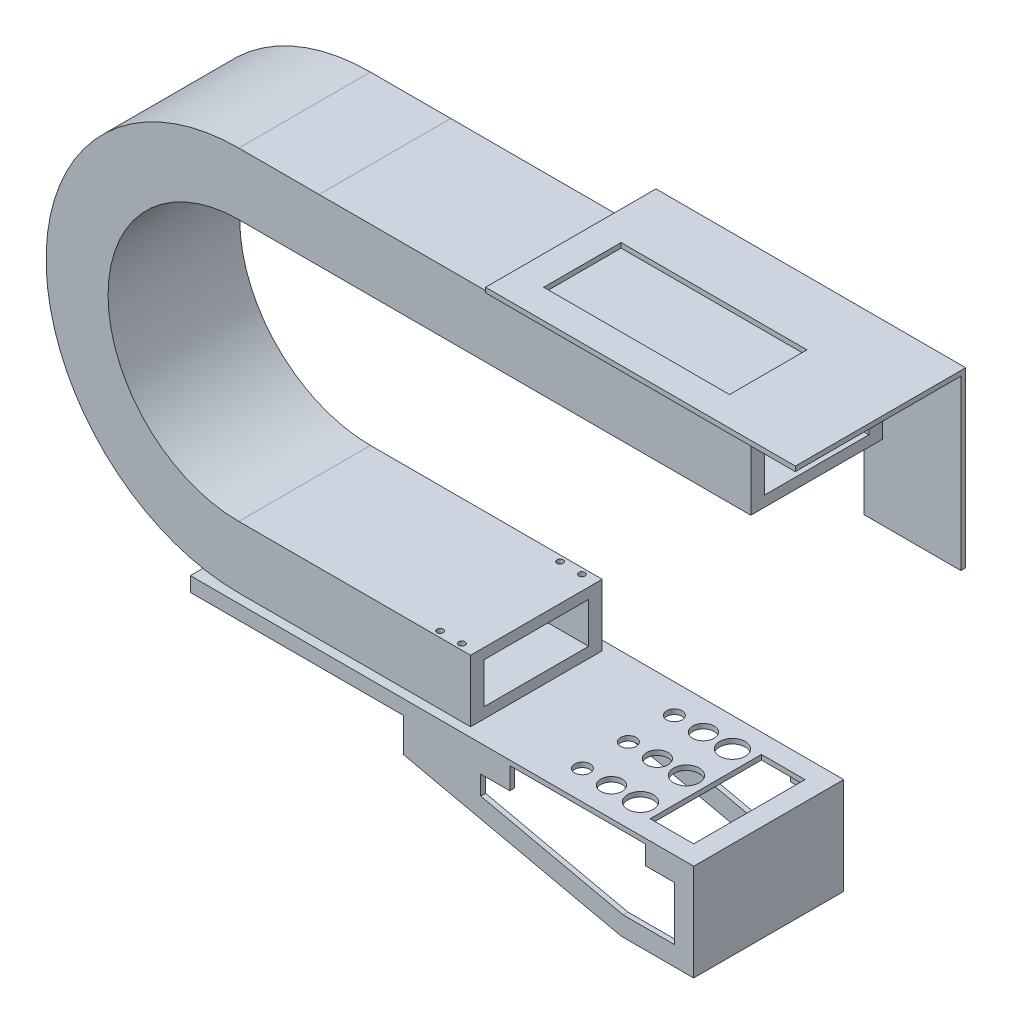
from build123d import *

# Parameters (mm, degrees)
QUERSCHNITT_W                   = 136
QUERSCHNITT_H                   = 64
QUERSCHNITT_W_2                 = 108
QUERSCHNITT_H_2                 = 42
BOHRUNG1_D                      = 6.5
BOHRUNG1_DEPTH                  = 334
BOHRUNG2_D                      = 6.5
BOHRUNG2_DEPTH                  = 64
LINEAR_AUSTRAGEN1_DEPTH         = 77.5
SKIZZE12_W                      = 145
SKIZZE12_H                      = 95
SCHNITT_LINEAR_AUSTRAGEN1_DEPTH = 515
LINEAR_AUSTRAGEN2_DEPTH         = 48
LINEAR_AUSTRAGEN2_DEPTH_BACK    = 272
SCHNITT_LINEAR_AUSTRAGEN2_REACH = 885.644
SKIZZE16_W                      = 192
SKIZZE16_H                      = 80
SCHNITT_LINEAR_AUSTRAGEN3_DEPTH = 5
SCHNITT_LINEAR_AUSTRAGEN4_REACH = 840.835
SKIZZE17_R                      = 13.25
SKIZZE17_R_2                    = 11.05
SKIZZE17_R_3                    = 8.05
SKIZZE17_W                      = 45
SKIZZE17_H                      = 115
SKIZZE17_W_2                    = 205
SKIZZE17_H_2                    = 80


with BuildPart() as part:
    # Austragung1: sweep along a path in Verlauf
    with BuildLine(Plane.XY) as austragung1_path:
        Line((0, 0), (-446, 0))
        ThreePointArc((-446, 0), (-446.020131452, 1.213e-06), (-446.040262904, 4.853e-06))
        Line((-446.040262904, 4.853e-06), (-528.959737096, 0.019995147))
        ThreePointArc((-528.959737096, 0.019995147), (-528.979868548, 0.019998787), (-529, 0.02))
        ThreePointArc((-529, 0.02), (-696.01, -166.99), (-529, -334))
        Line((-529, -334), (-446, -334))
        Line((-446, -334), (-289.51, -334))
    # Querschnitt → Austragung1 (sweep)
    with BuildSketch(Plane(origin=(0, 0, 0), x_dir=(0, 0, -1), z_dir=(1, 0, 0))):
        Rectangle(QUERSCHNITT_W, QUERSCHNITT_H)
        Rectangle(QUERSCHNITT_W_2, QUERSCHNITT_H_2, mode=Mode.SUBTRACT)
    sweep(path=austragung1_path.line)

    # Bohrung1
    with Locations(Plane(origin=(0, 32, 0), x_dir=(-1, 0, 0), z_dir=(0, 1, 0))):
        with Locations((37.5, -62), (15, -62), (15, 62), (37.5, 62)):
            Hole(BOHRUNG1_D / 2, depth=BOHRUNG1_DEPTH)

    # Bohrung2
    with Locations(Plane(origin=(0, -302, 0), x_dir=(-1, 0, 0), z_dir=(0, 1, 0))):
        with Locations((304.51, 62), (327.01, 62), (327.01, -62), (304.51, -62)):
            Hole(BOHRUNG2_D / 2, depth=BOHRUNG2_DEPTH)

    # Skizze6 → Linear austragen1 (add, symmetric)
    with BuildSketch(Plane.XY):
        Polygon((-124.51, -466), (-49.51, -466), (-49.51, -366), (-569.51, -366), (-569.51, -381), (-349.51, -381), (-349.51, -416), align=None)
        Polygon((-269.51, -413.289901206), (-122.314555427, -446), (-69.51, -446), (-69.51, -390.5), (-99.51, -390.5), (-99.51, -371), (-239.51, -371), (-239.51, -393.5), (-269.51, -393.5), align=None, mode=Mode.SUBTRACT)
    extrude(amount=LINEAR_AUSTRAGEN1_DEPTH, both=True)

    # Skizze12 → Schnitt-Linear austragen1 (cut)
    with BuildSketch(Plane.ZY.offset(569.51)):
        with Locations((0, -418.5)):
            Rectangle(SKIZZE12_W, SKIZZE12_H)
    extrude(amount=-SCHNITT_LINEAR_AUSTRAGEN1_DEPTH, mode=Mode.SUBTRACT)

    # Skizze9 → Linear austragen2 (add, two sides: drawn at the far end of the back side and taken through both)
    with BuildSketch(Plane(origin=(0, 0, 0), x_dir=(0, 0, -1), z_dir=(1, 0, 0)).offset(-LINEAR_AUSTRAGEN2_DEPTH_BACK)):
        Polygon((-70, 37), (106, 37), (106, -142), (101, -142), (101, 32), (-70, 32), align=None)
    extrude(amount=LINEAR_AUSTRAGEN2_DEPTH + LINEAR_AUSTRAGEN2_DEPTH_BACK)

    # Skizze15 → Schnitt-Linear austragen2 (cut, up to next)
    with BuildSketch(Plane(origin=(0, 0, -106), x_dir=(-1, 0, 0), z_dir=(0, 0, -1)), mode=Mode.PRIVATE) as schnitt_linear_austragen2_sk1:
        Polygon((52, -142), (52, -41.948822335), (272, 17), (272, -142), align=None)
    schnitt_linear_austragen2_tool1 = extrude(schnitt_linear_austragen2_sk1.sketch, amount=-SCHNITT_LINEAR_AUSTRAGEN2_REACH, mode=Mode.PRIVATE) & part.part
    add(schnitt_linear_austragen2_tool1.solids().sort_by_distance((-170.343744, -76.119356, -106))[0], mode=Mode.SUBTRACT)

    # Skizze16 → Schnitt-Linear austragen3 (cut)
    with BuildSketch(Plane(origin=(0, 37, 0), x_dir=(1, 0, 0), z_dir=(0, 1, 0))):
        with Locations((-146, 0)):
            Rectangle(SKIZZE16_W, SKIZZE16_H)
    extrude(amount=-SCHNITT_LINEAR_AUSTRAGEN3_DEPTH, mode=Mode.SUBTRACT)

    # Skizze17 → Schnitt-Linear austragen4 (cut, up to next)
    with BuildSketch(Plane(origin=(0, -366, 0), x_dir=(1, 0, 0), z_dir=(0, 1, 0)), mode=Mode.PRIVATE) as schnitt_linear_austragen4_sk1:
        with Locations(Location((-134.51, 0, 0), (0, 0, 270))):
            Circle(SKIZZE17_R)
    schnitt_linear_austragen4_tool1 = extrude(schnitt_linear_austragen4_sk1.sketch, amount=-SCHNITT_LINEAR_AUSTRAGEN4_REACH, mode=Mode.PRIVATE) & part.part
    # Skizze17 → Schnitt-Linear austragen4 (cut, up to next)
    with BuildSketch(Plane(origin=(0, -366, 0), x_dir=(1, 0, 0), z_dir=(0, 1, 0)), mode=Mode.PRIVATE) as schnitt_linear_austragen4_sk2:
        with Locations(Location((-134.51, 47.5, 0), (0, 0, 270))):
            Circle(SKIZZE17_R)
    schnitt_linear_austragen4_tool2 = extrude(schnitt_linear_austragen4_sk2.sketch, amount=-SCHNITT_LINEAR_AUSTRAGEN4_REACH, mode=Mode.PRIVATE) & part.part
    # Skizze17 → Schnitt-Linear austragen4 (cut, up to next)
    with BuildSketch(Plane(origin=(0, -366, 0), x_dir=(1, 0, 0), z_dir=(0, 1, 0)), mode=Mode.PRIVATE) as schnitt_linear_austragen4_sk3:
        with Locations(Location((-134.51, -47.5, 0), (0, 0, 270))):
            Circle(SKIZZE17_R)
    schnitt_linear_austragen4_tool3 = extrude(schnitt_linear_austragen4_sk3.sketch, amount=-SCHNITT_LINEAR_AUSTRAGEN4_REACH, mode=Mode.PRIVATE) & part.part
    # Skizze17 → Schnitt-Linear austragen4 (cut, up to next)
    with BuildSketch(Plane(origin=(0, -366, 0), x_dir=(1, 0, 0), z_dir=(0, 1, 0)), mode=Mode.PRIVATE) as schnitt_linear_austragen4_sk4:
        with Locations(Location((-164.51, 0, 0), (0, 0, 270))):
            Circle(SKIZZE17_R_2)
    schnitt_linear_austragen4_tool4 = extrude(schnitt_linear_austragen4_sk4.sketch, amount=-SCHNITT_LINEAR_AUSTRAGEN4_REACH, mode=Mode.PRIVATE) & part.part
    # Skizze17 → Schnitt-Linear austragen4 (cut, up to next)
    with BuildSketch(Plane(origin=(0, -366, 0), x_dir=(1, 0, 0), z_dir=(0, 1, 0)), mode=Mode.PRIVATE) as schnitt_linear_austragen4_sk5:
        with Locations(Location((-164.51, -47.5, 0), (0, 0, 270))):
            Circle(SKIZZE17_R_2)
    schnitt_linear_austragen4_tool5 = extrude(schnitt_linear_austragen4_sk5.sketch, amount=-SCHNITT_LINEAR_AUSTRAGEN4_REACH, mode=Mode.PRIVATE) & part.part
    # Skizze17 → Schnitt-Linear austragen4 (cut, up to next)
    with BuildSketch(Plane(origin=(0, -366, 0), x_dir=(1, 0, 0), z_dir=(0, 1, 0)), mode=Mode.PRIVATE) as schnitt_linear_austragen4_sk6:
        with Locations(Location((-164.51, 47.5, 0), (0, 0, 270))):
            Circle(SKIZZE17_R_2)
    schnitt_linear_austragen4_tool6 = extrude(schnitt_linear_austragen4_sk6.sketch, amount=-SCHNITT_LINEAR_AUSTRAGEN4_REACH, mode=Mode.PRIVATE) & part.part
    # Skizze17 → Schnitt-Linear austragen4 (cut, up to next)
    with BuildSketch(Plane(origin=(0, -366, 0), x_dir=(1, 0, 0), z_dir=(0, 1, 0)), mode=Mode.PRIVATE) as schnitt_linear_austragen4_sk7:
        with Locations(Location((-194.51, 47.5, 0), (0, 0, 270))):
            Circle(SKIZZE17_R_3)
    schnitt_linear_austragen4_tool7 = extrude(schnitt_linear_austragen4_sk7.sketch, amount=-SCHNITT_LINEAR_AUSTRAGEN4_REACH, mode=Mode.PRIVATE) & part.part
    # Skizze17 → Schnitt-Linear austragen4 (cut, up to next)
    with BuildSketch(Plane(origin=(0, -366, 0), x_dir=(1, 0, 0), z_dir=(0, 1, 0)), mode=Mode.PRIVATE) as schnitt_linear_austragen4_sk8:
        with Locations(Location((-194.51, 0, 0), (0, 0, 270))):
            Circle(SKIZZE17_R_3)
    schnitt_linear_austragen4_tool8 = extrude(schnitt_linear_austragen4_sk8.sketch, amount=-SCHNITT_LINEAR_AUSTRAGEN4_REACH, mode=Mode.PRIVATE) & part.part
    # Skizze17 → Schnitt-Linear austragen4 (cut, up to next)
    with BuildSketch(Plane(origin=(0, -366, 0), x_dir=(1, 0, 0), z_dir=(0, 1, 0)), mode=Mode.PRIVATE) as schnitt_linear_austragen4_sk9:
        with Locations(Location((-194.51, -47.5, 0), (0, 0, 270))):
            Circle(SKIZZE17_R_3)
    schnitt_linear_austragen4_tool9 = extrude(schnitt_linear_austragen4_sk9.sketch, amount=-SCHNITT_LINEAR_AUSTRAGEN4_REACH, mode=Mode.PRIVATE) & part.part
    # Skizze17 → Schnitt-Linear austragen4 (cut, up to next)
    with BuildSketch(Plane(origin=(0, -366, 0), x_dir=(1, 0, 0), z_dir=(0, 1, 0)), mode=Mode.PRIVATE) as schnitt_linear_austragen4_sk10:
        with Locations((-92.01, 0)):
            Rectangle(SKIZZE17_W, SKIZZE17_H)
    schnitt_linear_austragen4_tool10 = extrude(schnitt_linear_austragen4_sk10.sketch, amount=-SCHNITT_LINEAR_AUSTRAGEN4_REACH, mode=Mode.PRIVATE) & part.part
    # Skizze17 → Schnitt-Linear austragen4 (cut, up to next)
    with BuildSketch(Plane(origin=(0, -366, 0), x_dir=(1, 0, 0), z_dir=(0, 1, 0)), mode=Mode.PRIVATE) as schnitt_linear_austragen4_sk11:
        with Locations((-442.01, 0)):
            Rectangle(SKIZZE17_W_2, SKIZZE17_H_2)
    schnitt_linear_austragen4_tool11 = extrude(schnitt_linear_austragen4_sk11.sketch, amount=-SCHNITT_LINEAR_AUSTRAGEN4_REACH, mode=Mode.PRIVATE) & part.part
    add(schnitt_linear_austragen4_tool1.solids().sort_by_distance((-134.51, -366, 0))[0], mode=Mode.SUBTRACT)
    add(schnitt_linear_austragen4_tool2.solids().sort_by_distance((-134.51, -366, -47.5))[0], mode=Mode.SUBTRACT)
    add(schnitt_linear_austragen4_tool3.solids().sort_by_distance((-134.51, -366, 47.5))[0], mode=Mode.SUBTRACT)
    add(schnitt_linear_austragen4_tool4.solids().sort_by_distance((-164.51, -366, 0))[0], mode=Mode.SUBTRACT)
    add(schnitt_linear_austragen4_tool5.solids().sort_by_distance((-164.51, -366, 47.5))[0], mode=Mode.SUBTRACT)
    add(schnitt_linear_austragen4_tool6.solids().sort_by_distance((-164.51, -366, -47.5))[0], mode=Mode.SUBTRACT)
    add(schnitt_linear_austragen4_tool7.solids().sort_by_distance((-194.51, -366, -47.5))[0], mode=Mode.SUBTRACT)
    add(schnitt_linear_austragen4_tool8.solids().sort_by_distance((-194.51, -366, 0))[0], mode=Mode.SUBTRACT)
    add(schnitt_linear_austragen4_tool9.solids().sort_by_distance((-194.51, -366, 47.5))[0], mode=Mode.SUBTRACT)
    add(schnitt_linear_austragen4_tool10.solids().sort_by_distance((-92.01, -366, 0))[0], mode=Mode.SUBTRACT)
    add(schnitt_linear_austragen4_tool11.solids().sort_by_distance((-442.01, -366, 0))[0], mode=Mode.SUBTRACT)


solid = part.part
